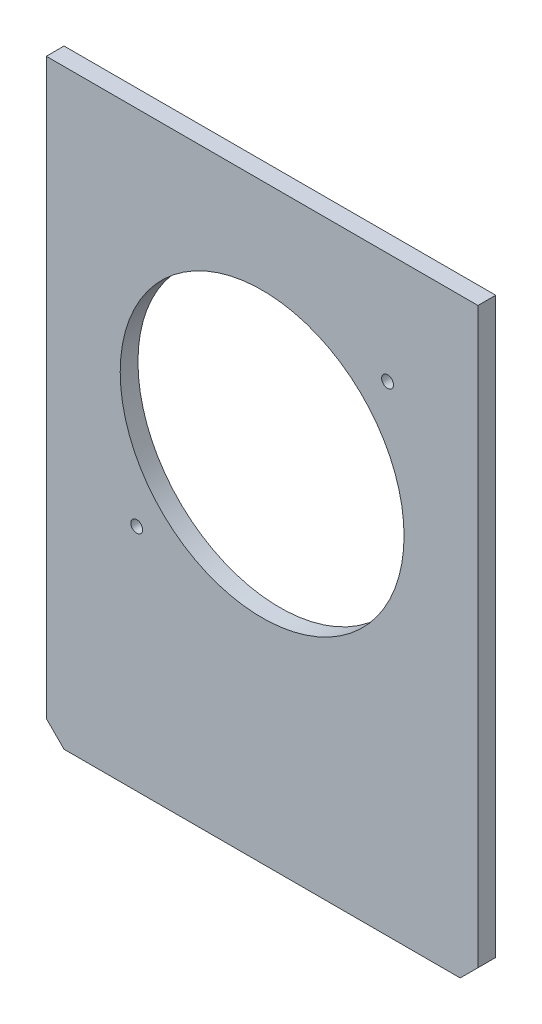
from build123d import *

# Parameters (mm, degrees)
ESQUISSE1_W      = 73
ESQUISSE1_H      = 100
ESQUISSE1_R      = 24
ESQUISSE1_R_2    = 1
EXTRUSION1_DEPTH = 3
CHANFREIN1_SIZE  = 3


with BuildPart() as part:
    # Esquisse1 → Extrusion1 (new body)
    with BuildSketch(Plane.XY):
        with Locations((19.463871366, -20.395710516)):
            Rectangle(ESQUISSE1_W, ESQUISSE1_H)
        with Locations((19.463871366, -10.395710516)):
            Circle(ESQUISSE1_R, mode=Mode.SUBTRACT)
        with Locations((40.677074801, 10.81749292)):
            Circle(ESQUISSE1_R_2, mode=Mode.SUBTRACT)
        with Locations((-1.74933207, -31.608913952)):
            Circle(ESQUISSE1_R_2, mode=Mode.SUBTRACT)
    extrude(amount=EXTRUSION1_DEPTH)

    # Chanfrein1
    chanfrein1_edges = [part.edges().sort_by_distance(p)[0] for p in [
        (55.963871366, -70.395710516, 1.5),
        (-17.036128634, -70.395710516, 1.5),
    ]]
    chamfer(chanfrein1_edges, length=CHANFREIN1_SIZE)


solid = part.part
